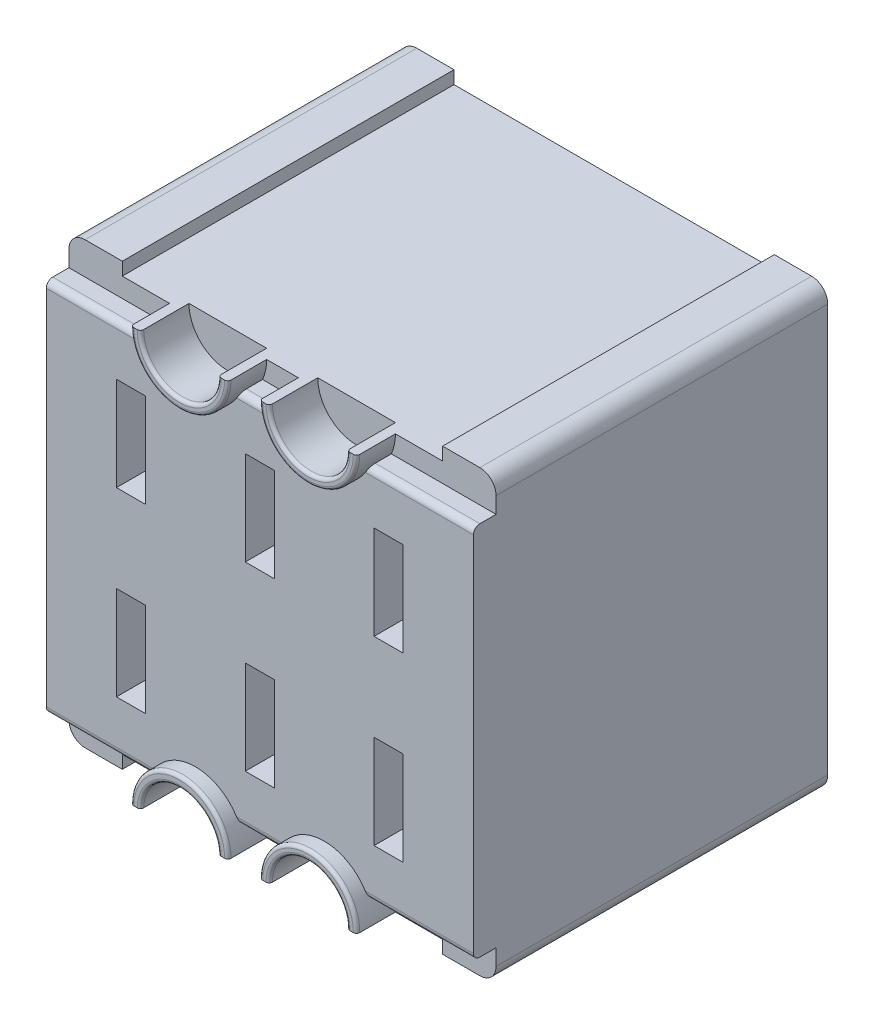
from build123d import *

# Parameters (mm, degrees)
ESQUISSE1_W             = 13.199999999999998
ESQUISSE1_H             = 13.599999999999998
BOSS_EXTRU_1_DEPTH      = 11.45
ESQUISSE2_W             = 9.9
ESQUISSE2_H             = 0.4
ENL_V_MAT_EXTRU_1_DEPTH = 23.142775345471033
ENL_V_MAT_EXTRU_4_DEPTH = 0.5
ENL_V_MAT_EXTRU_5_DEPTH = 1.5
ENL_V_MAT_EXTRU_7_DEPTH = 0.7
CONG_2_R                = 0.5
CONG_3_R                = 0.1
CONG_4_R                = 0.2
ESQUISSE7_W             = 0.8999999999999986
ESQUISSE7_H             = 2.9
ESQUISSE7_H_2           = 2.9000000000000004
ENL_V_MAT_EXTRU_8_DEPTH = 22.888410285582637
ENL_V_MAT_EXTRU_9_DEPTH = 0.5


with BuildPart() as part:
    # Esquisse1 → Boss.-Extru.1 (new body)
    with BuildSketch(Plane.XY):
        with Locations((6.599999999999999, 6.799999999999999)):
            Rectangle(ESQUISSE1_W, ESQUISSE1_H)
    extrude(amount=-BOSS_EXTRU_1_DEPTH)

    # Esquisse2 → Enl_v. mat.-Extru.1 (cut, through all)
    with BuildSketch(Plane.XY):
        Polygon((1.6500000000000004, 13.6), (11.55, 13.599999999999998), (11.55, 13.2), (1.65, 13.2), align=None)
        with Locations((6.6000000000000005, 0.2)):
            Rectangle(ESQUISSE2_W, ESQUISSE2_H)
    extrude(amount=-ENL_V_MAT_EXTRU_1_DEPTH, mode=Mode.SUBTRACT)

    # Esquisse4 → Enl_v. mat.-Extru.4 (cut)
    with BuildSketch(Plane.XY):
        with BuildLine():
            Line((3.1100000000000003, 13.2), (1.65, 13.2))
            Line((1.65, 13.2), (1.6500000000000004, 13.6))
            Line((1.6500000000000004, 13.6), (0, 13.6))
            Line((0, 13.6), (0, 0))
            Line((0, 0), (1.65, 0))
            Line((1.65, 0), (1.65, 0.4))
            Line((1.65, 0.4), (3.1100000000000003, 0.4))
            ThreePointArc((3.1100000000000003, 0.4), (4.61, 1.9000000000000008), (6.110000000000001, 0.4))
            Line((6.110000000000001, 0.4), (7.090000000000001, 0.4))
            ThreePointArc((7.090000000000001, 0.4), (8.59, 1.9), (10.09, 0.4))
            Line((10.09, 0.4), (11.55, 0.4))
            Line((11.55, 0.4), (11.55, 0))
            Line((11.55, 0), (13.199999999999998, 0))
            Line((13.199999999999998, 0), (13.199999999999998, 13.599999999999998))
            Line((13.199999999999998, 13.599999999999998), (11.55, 13.599999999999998))
            Line((11.55, 13.599999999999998), (11.55, 13.2))
            Line((11.55, 13.2), (10.09, 13.2))
            ThreePointArc((10.09, 13.2), (8.59, 11.7), (7.090000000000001, 13.2))
            Line((7.090000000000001, 13.2), (6.110000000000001, 13.2))
            ThreePointArc((6.110000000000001, 13.2), (4.61, 11.7), (3.1100000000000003, 13.2))
        make_face()
    extrude(amount=-ENL_V_MAT_EXTRU_4_DEPTH, mode=Mode.SUBTRACT)

    # Esquisse5 → Enl_v. mat.-Extru.5 (cut)
    with BuildSketch(Plane.XY):
        with BuildLine():
            Line((3.4100000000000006, 13.2), (5.8100000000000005, 13.2))
            ThreePointArc((5.8100000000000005, 13.2), (4.61, 12), (3.4100000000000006, 13.2))
        make_face()
        with BuildLine():
            Line((7.390000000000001, 13.2), (9.790000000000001, 13.2))
            ThreePointArc((9.790000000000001, 13.2), (8.59, 11.999999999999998), (7.390000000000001, 13.2))
        make_face()
        with BuildLine():
            Line((3.4104721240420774, 0.4), (5.809527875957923, 0.4))
            ThreePointArc((5.809527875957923, 0.4), (4.61, 1.5663417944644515), (3.4104721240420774, 0.4))
        make_face()
        with BuildLine():
            Line((7.390000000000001, 0.3999999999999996), (9.790000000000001, 0.39999999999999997))
            ThreePointArc((9.790000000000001, 0.39999999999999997), (8.59, 1.600000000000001), (7.390000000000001, 0.3999999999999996))
        make_face()
    extrude(amount=-ENL_V_MAT_EXTRU_5_DEPTH, mode=Mode.SUBTRACT)

    # Esquisse6 → Enl_v. mat.-Extru.7 (cut)
    with BuildSketch(Plane.XY.offset(-0.5)):
        with BuildLine():
            ThreePointArc((3.2352272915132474, 12.6), (3.1416405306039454, 12.893535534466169), (3.1100000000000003, 13.2))
            Line((3.1100000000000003, 13.2), (1.65, 13.2))
            Line((1.65, 13.2), (1.6500000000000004, 13.6))
            Line((1.6500000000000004, 13.6), (0, 13.6))
            Line((0, 13.6), (-7.1e-16, 12.6))
            Line((-7.1e-16, 12.6), (3.235227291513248, 12.6))
        make_face()
        with BuildLine():
            ThreePointArc((6.110000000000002, 13.2), (6.078359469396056, 12.893535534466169), (5.984772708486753, 12.6))
            Line((5.984772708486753, 12.6), (7.215227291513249, 12.6))
            ThreePointArc((7.21522729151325, 12.6), (7.121640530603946, 12.893535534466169), (7.090000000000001, 13.2))
            Line((7.090000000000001, 13.2), (6.110000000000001, 13.2))
        make_face()
        with BuildLine():
            ThreePointArc((10.09, 13.2), (10.058359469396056, 12.893535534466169), (9.964772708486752, 12.6))
            Line((9.964772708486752, 12.6), (13.199999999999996, 12.6))
            Line((13.199999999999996, 12.6), (13.199999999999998, 13.599999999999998))
            Line((13.199999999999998, 13.599999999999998), (11.55, 13.599999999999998))
            Line((11.55, 13.599999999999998), (11.55, 13.2))
            Line((11.55, 13.2), (10.09, 13.2))
        make_face()
        with BuildLine():
            Line((13.199999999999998, 0), (13.199999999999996, 1))
            Line((13.199999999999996, 1), (9.964772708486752, 1))
            ThreePointArc((9.964772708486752, 1), (10.058359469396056, 0.7064644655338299), (10.09, 0.39999999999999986))
            Line((10.09, 0.4), (11.55, 0.4))
            Line((11.55, 0.4), (11.55, 0))
            Line((11.55, 0), (13.199999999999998, 0))
        make_face()
        with BuildLine():
            Line((7.215227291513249, 1), (5.9847727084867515, 1))
            ThreePointArc((5.9847727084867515, 1), (6.078359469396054, 0.7064644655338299), (6.109999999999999, 0.3999999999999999))
            Line((6.109999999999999, 0.4), (7.090000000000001, 0.4000000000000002))
            ThreePointArc((7.090000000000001, 0.4000000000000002), (7.121640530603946, 0.70646446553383), (7.215227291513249, 1))
        make_face()
        with BuildLine():
            Line((3.2352272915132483, 1), (0, 1))
            Line((0, 1), (0, 0))
            Line((0, 0), (1.65, 0))
            Line((1.65, 0), (1.65, 0.4))
            Line((1.65, 0.4), (3.1100000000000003, 0.4))
            ThreePointArc((3.1100000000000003, 0.4), (3.1416405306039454, 0.7064644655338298), (3.2352272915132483, 0.9999999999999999))
        make_face()
    extrude(amount=-ENL_V_MAT_EXTRU_7_DEPTH, mode=Mode.SUBTRACT)

    # Cong_2
    cong_2_edges = [part.edges().sort_by_distance(p)[0] for p in [
        (0, 13.6, -6.325),
        (13.199999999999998, 13.6, -6.325),
        (13.199999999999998, 0, -6.325),
        (0, 0, -6.325),
    ]]
    fillet(cong_2_edges, radius=CONG_2_R)

    # Cong_3
    cong_3_edges = [part.edges().sort_by_distance(p)[0] for p in [
        (4.610000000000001, 12, 0),
        (8.590000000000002, 11.999999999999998, 0),
        (4.61, 1.5663417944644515, 0),
        (8.590000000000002, 1.6000000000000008, 0),
        (4.610000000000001, 11.7, 0),
        (4.610000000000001, 1.9000000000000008, 0),
        (8.59, 1.9, 0),
        (8.59, 11.7, 0),
    ]]
    fillet(cong_3_edges, radius=CONG_3_R)

    # Cong_4
    cong_4_edges = [part.edges().sort_by_distance(p)[0] for p in [
        (1.6176136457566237, 12.6, -0.5),
        (6.600000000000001, 12.6, -0.5),
        (11.582386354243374, 12.6, -0.5),
        (11.582386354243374, 1, -0.5),
        (6.6, 1, -0.5),
        (1.6176136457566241, 1, -0.5),
    ]]
    fillet(cong_4_edges, radius=CONG_4_R)

    # Esquisse7 → Enl_v. mat.-Extru.8 (cut, through all)
    with BuildSketch(Plane.XY.offset(-0.5)):
        Polygon((2.169999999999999, 5.45), (3.0699999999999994, 5.45), (3.07, 2.5500000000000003), (2.1699999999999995, 2.5500000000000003), align=None)
        with Locations((6.6, 4)):
            Rectangle(ESQUISSE7_W, ESQUISSE7_H)
        with Locations((10.58, 4)):
            Rectangle(ESQUISSE7_W, ESQUISSE7_H)
        with Locations((10.58, 9.599999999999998)):
            Rectangle(ESQUISSE7_W, ESQUISSE7_H_2)
        with Locations((6.6, 9.599999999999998)):
            Rectangle(ESQUISSE7_W, ESQUISSE7_H_2)
        Polygon((3.0699999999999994, 8.149999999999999), (3.07, 11.049999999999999), (2.1699999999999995, 11.049999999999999), (2.169999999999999, 8.149999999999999), align=None)
    extrude(amount=-ENL_V_MAT_EXTRU_8_DEPTH, mode=Mode.SUBTRACT)

    # Esquisse8 → Enl_v. mat.-Extru.9 (cut)
    with BuildSketch(Plane(origin=(0, 0, -11.45), x_dir=(-1, 0, 0), z_dir=(0, 0, -1))):
        Polygon((-11.549999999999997, 12.4), (-1.65, 12.4), (-1.6500000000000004, 1.2000000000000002), (-11.549999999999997, 1.2000000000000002), align=None)
    extrude(amount=-ENL_V_MAT_EXTRU_9_DEPTH, mode=Mode.SUBTRACT)


solid = part.part
